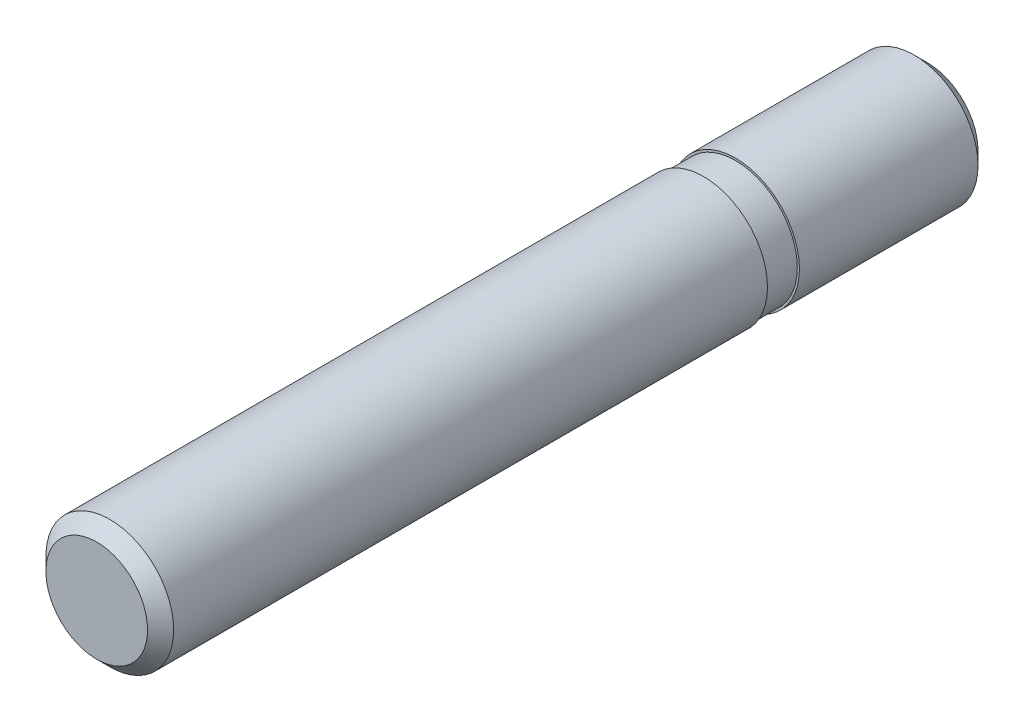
ISO-10303-21;
HEADER;
FILE_DESCRIPTION(('STEP AP214'),'2;1');
FILE_NAME('part.step','',(''),(''),'','','');
FILE_SCHEMA(('AUTOMOTIVE_DESIGN { 1 0 10303 214 1 1 1 1 }'));
ENDSEC;
DATA;
#1=APPLICATION_CONTEXT('core data for automotive mechanical design processes');
#2=APPLICATION_PROTOCOL_DEFINITION('international standard','automotive_design',2000,#1);
#3=PRODUCT_CONTEXT('',#1,'mechanical');
#4=PRODUCT('Part','Part','',(#3));
#5=PRODUCT_RELATED_PRODUCT_CATEGORY('part','',(#4));
#6=PRODUCT_DEFINITION_FORMATION('','',#4);
#7=PRODUCT_DEFINITION_CONTEXT('part definition',#1,'design');
#8=PRODUCT_DEFINITION('design','',#6,#7);
#9=PRODUCT_DEFINITION_SHAPE('','',#8);
#10=(LENGTH_UNIT() NAMED_UNIT(*) SI_UNIT(.MILLI.,.METRE.));
#11=(NAMED_UNIT(*) PLANE_ANGLE_UNIT() SI_UNIT($,.RADIAN.));
#12=(NAMED_UNIT(*) SI_UNIT($,.STERADIAN.) SOLID_ANGLE_UNIT());
#13=UNCERTAINTY_MEASURE_WITH_UNIT(LENGTH_MEASURE(1.E-05),#10,'distance_accuracy_value','');
#14=(GEOMETRIC_REPRESENTATION_CONTEXT(3) GLOBAL_UNCERTAINTY_ASSIGNED_CONTEXT((#13)) GLOBAL_UNIT_ASSIGNED_CONTEXT((#10,
#11,#12)) REPRESENTATION_CONTEXT('',''));
#15=CARTESIAN_POINT('',(0.,0.,0.));
#16=DIRECTION('',(0.,0.,1.));
#17=DIRECTION('',(1.,0.,0.));
#18=AXIS2_PLACEMENT_3D('',#15,#16,#17);
#19=CARTESIAN_POINT('',(0.,1.19325,-9.));
#20=DIRECTION('',(0.,0.,-1.));
#21=DIRECTION('',(-1.,0.,0.));
#22=AXIS2_PLACEMENT_3D('',#19,#20,#21);
#23=PLANE('',#22);
#24=CARTESIAN_POINT('',(0.,0.,-9.));
#25=DIRECTION('',(0.,0.,1.));
#26=DIRECTION('',(1.,0.,0.));
#27=AXIS2_PLACEMENT_3D('',#24,#25,#26);
#28=CIRCLE('',#27,2.38649999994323);
#29=CARTESIAN_POINT('',(2.38649999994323,0.,-9.));
#30=VERTEX_POINT('',#29);
#31=EDGE_CURVE('E19',#30,#30,#28,.T.);
#32=ORIENTED_EDGE('',*,*,#31,.F.);
#33=EDGE_LOOP('',(#32));
#34=FACE_BOUND('',#33,.T.);
#35=ADVANCED_FACE('F12',(#34),#23,.T.);
#36=CARTESIAN_POINT('',(0.,0.,-8.38649999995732));
#37=DIRECTION('',(0.,0.,1.));
#38=DIRECTION('',(1.,0.,0.));
#39=AXIS2_PLACEMENT_3D('',#36,#37,#38);
#40=CONICAL_SURFACE('',#39,2.99999999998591,0.785398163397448);
#41=CARTESIAN_POINT('',(0.,0.,-8.3865));
#42=DIRECTION('',(0.,0.,1.));
#43=DIRECTION('',(1.,0.,0.));
#44=AXIS2_PLACEMENT_3D('',#41,#42,#43);
#45=CIRCLE('',#44,3.);
#46=CARTESIAN_POINT('',(3.,0.,-8.3865));
#47=VERTEX_POINT('',#46);
#48=EDGE_CURVE('E23',#47,#47,#45,.T.);
#49=ORIENTED_EDGE('',*,*,#48,.F.);
#50=EDGE_LOOP('',(#49));
#51=FACE_BOUND('',#50,.T.);
#52=ORIENTED_EDGE('',*,*,#31,.T.);
#53=EDGE_LOOP('',(#52));
#54=FACE_BOUND('',#53,.T.);
#55=ADVANCED_FACE('F66',(#51,#54),#40,.T.);
#56=CARTESIAN_POINT('',(0.,0.,6.25));
#57=DIRECTION('',(0.,0.,1.));
#58=DIRECTION('',(1.,0.,0.));
#59=AXIS2_PLACEMENT_3D('',#56,#57,#58);
#60=CYLINDRICAL_SURFACE('',#59,3.);
#61=CARTESIAN_POINT('',(0.,0.,0.));
#62=DIRECTION('',(0.,0.,1.));
#63=DIRECTION('',(1.,0.,0.));
#64=AXIS2_PLACEMENT_3D('',#61,#62,#63);
#65=CIRCLE('',#64,3.);
#66=CARTESIAN_POINT('',(3.,0.,0.));
#67=VERTEX_POINT('',#66);
#68=EDGE_CURVE('E28',#67,#67,#65,.T.);
#69=ORIENTED_EDGE('',*,*,#68,.F.);
#70=EDGE_LOOP('',(#69));
#71=FACE_BOUND('',#70,.T.);
#72=ORIENTED_EDGE('',*,*,#48,.T.);
#73=EDGE_LOOP('',(#72));
#74=FACE_BOUND('',#73,.T.);
#75=ADVANCED_FACE('F72',(#71,#74),#60,.T.);
#76=CARTESIAN_POINT('',(0.,0.,0.));
#77=DIRECTION('',(0.,0.,1.));
#78=DIRECTION('',(1.,0.,0.));
#79=AXIS2_PLACEMENT_3D('',#76,#77,#78);
#80=PLANE('',#79);
#81=CARTESIAN_POINT('',(0.,0.,0.));
#82=DIRECTION('',(0.,0.,1.));
#83=DIRECTION('',(1.,0.,0.));
#84=AXIS2_PLACEMENT_3D('',#81,#82,#83);
#85=CIRCLE('',#84,2.9);
#86=CARTESIAN_POINT('',(2.9,0.,0.));
#87=VERTEX_POINT('',#86);
#88=EDGE_CURVE('E8',#87,#87,#85,.T.);
#89=ORIENTED_EDGE('',*,*,#88,.F.);
#90=EDGE_LOOP('',(#89));
#91=FACE_BOUND('',#90,.T.);
#92=ORIENTED_EDGE('',*,*,#68,.T.);
#93=EDGE_LOOP('',(#92));
#94=FACE_BOUND('',#93,.T.);
#95=ADVANCED_FACE('F77',(#91,#94),#80,.T.);
#96=CARTESIAN_POINT('',(0.,0.,-1.91771008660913));
#97=DIRECTION('',(0.,0.,-1.));
#98=DIRECTION('',(-1.,0.,0.));
#99=AXIS2_PLACEMENT_3D('',#96,#97,#98);
#100=CYLINDRICAL_SURFACE('',#99,2.9);
#101=CARTESIAN_POINT('',(0.,0.,1.5));
#102=DIRECTION('',(0.,0.,-1.));
#103=DIRECTION('',(-1.,0.,0.));
#104=AXIS2_PLACEMENT_3D('',#101,#102,#103);
#105=CIRCLE('',#104,2.9);
#106=CARTESIAN_POINT('',(-2.9,0.,1.5));
#107=VERTEX_POINT('',#106);
#108=EDGE_CURVE('E44',#107,#107,#105,.T.);
#109=ORIENTED_EDGE('',*,*,#108,.T.);
#110=EDGE_LOOP('',(#109));
#111=FACE_BOUND('',#110,.T.);
#112=ORIENTED_EDGE('',*,*,#88,.T.);
#113=EDGE_LOOP('',(#112));
#114=FACE_BOUND('',#113,.T.);
#115=ADVANCED_FACE('F51',(#111,#114),#100,.T.);
#116=CARTESIAN_POINT('',(0.,0.,30.));
#117=DIRECTION('',(0.,0.,1.));
#118=DIRECTION('',(1.,0.,0.));
#119=AXIS2_PLACEMENT_3D('',#116,#117,#118);
#120=PLANE('',#119);
#121=CARTESIAN_POINT('',(0.,0.,30.));
#122=DIRECTION('',(0.,0.,1.));
#123=DIRECTION('',(1.,0.,0.));
#124=AXIS2_PLACEMENT_3D('',#121,#122,#123);
#125=CIRCLE('',#124,2.3865);
#126=CARTESIAN_POINT('',(2.3865,0.,30.));
#127=VERTEX_POINT('',#126);
#128=EDGE_CURVE('E40',#127,#127,#125,.T.);
#129=ORIENTED_EDGE('',*,*,#128,.T.);
#130=EDGE_LOOP('',(#129));
#131=FACE_BOUND('',#130,.T.);
#132=ADVANCED_FACE('F85',(#131),#120,.T.);
#133=CARTESIAN_POINT('',(0.,0.,30.));
#134=DIRECTION('',(0.,0.,-1.));
#135=DIRECTION('',(-1.,0.,0.));
#136=AXIS2_PLACEMENT_3D('',#133,#134,#135);
#137=CONICAL_SURFACE('',#136,2.3865,0.785398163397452);
#138=CARTESIAN_POINT('',(0.,0.,29.3865));
#139=DIRECTION('',(0.,0.,1.));
#140=DIRECTION('',(1.,0.,0.));
#141=AXIS2_PLACEMENT_3D('',#138,#139,#140);
#142=CIRCLE('',#141,3.);
#143=CARTESIAN_POINT('',(3.,0.,29.3865));
#144=VERTEX_POINT('',#143);
#145=EDGE_CURVE('E31',#144,#144,#142,.F.);
#146=ORIENTED_EDGE('',*,*,#145,.F.);
#147=EDGE_LOOP('',(#146));
#148=FACE_BOUND('',#147,.T.);
#149=ORIENTED_EDGE('',*,*,#128,.F.);
#150=EDGE_LOOP('',(#149));
#151=FACE_BOUND('',#150,.T.);
#152=ADVANCED_FACE('F62',(#148,#151),#137,.T.);
#153=CARTESIAN_POINT('',(0.,0.,6.25));
#154=DIRECTION('',(0.,0.,1.));
#155=DIRECTION('',(1.,0.,0.));
#156=AXIS2_PLACEMENT_3D('',#153,#154,#155);
#157=CYLINDRICAL_SURFACE('',#156,3.);
#158=CARTESIAN_POINT('',(0.,0.,1.5));
#159=DIRECTION('',(0.,0.,1.));
#160=DIRECTION('',(1.,0.,0.));
#161=AXIS2_PLACEMENT_3D('',#158,#159,#160);
#162=CIRCLE('',#161,3.);
#163=CARTESIAN_POINT('',(3.,0.,1.5));
#164=VERTEX_POINT('',#163);
#165=EDGE_CURVE('E35',#164,#164,#162,.T.);
#166=ORIENTED_EDGE('',*,*,#165,.T.);
#167=EDGE_LOOP('',(#166));
#168=FACE_BOUND('',#167,.T.);
#169=ORIENTED_EDGE('',*,*,#145,.T.);
#170=EDGE_LOOP('',(#169));
#171=FACE_BOUND('',#170,.T.);
#172=ADVANCED_FACE('F14',(#168,#171),#157,.T.);
#173=CARTESIAN_POINT('',(0.,0.,1.5));
#174=DIRECTION('',(0.,0.,1.));
#175=DIRECTION('',(1.,0.,0.));
#176=AXIS2_PLACEMENT_3D('',#173,#174,#175);
#177=PLANE('',#176);
#178=ORIENTED_EDGE('',*,*,#108,.F.);
#179=EDGE_LOOP('',(#178));
#180=FACE_BOUND('',#179,.T.);
#181=ORIENTED_EDGE('',*,*,#165,.F.);
#182=EDGE_LOOP('',(#181));
#183=FACE_BOUND('',#182,.T.);
#184=ADVANCED_FACE('F53',(#180,#183),#177,.F.);
#185=CLOSED_SHELL('',(#35,#55,#75,#95,#115,#132,#152,#172,#184));
#186=MANIFOLD_SOLID_BREP('B1',#185);
#187=ADVANCED_BREP_SHAPE_REPRESENTATION('',(#18,#186),#14);
#188=SHAPE_DEFINITION_REPRESENTATION(#9,#187);
ENDSEC;
END-ISO-10303-21;
